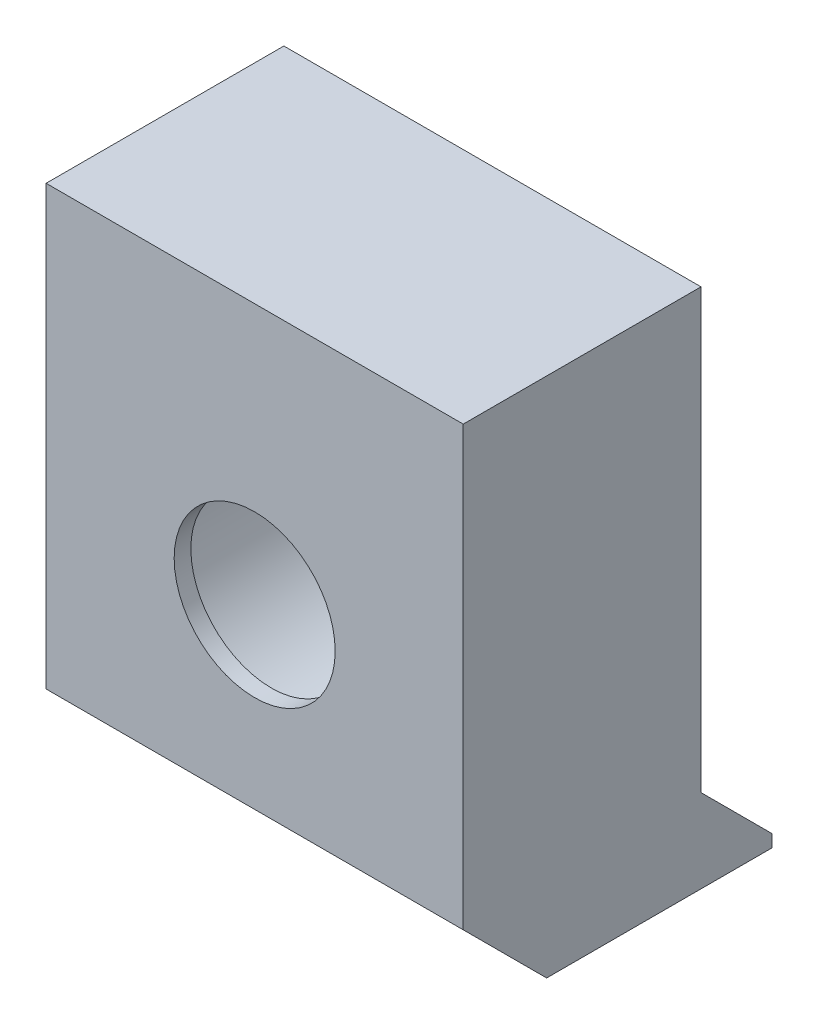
ISO-10303-21;
HEADER;
FILE_DESCRIPTION(('STEP AP214'),'2;1');
FILE_NAME('part.step','',(''),(''),'','','');
FILE_SCHEMA(('AUTOMOTIVE_DESIGN { 1 0 10303 214 1 1 1 1 }'));
ENDSEC;
DATA;
#1=APPLICATION_CONTEXT('core data for automotive mechanical design processes');
#2=APPLICATION_PROTOCOL_DEFINITION('international standard','automotive_design',2000,#1);
#3=PRODUCT_CONTEXT('',#1,'mechanical');
#4=PRODUCT('Part','Part','',(#3));
#5=PRODUCT_RELATED_PRODUCT_CATEGORY('part','',(#4));
#6=PRODUCT_DEFINITION_FORMATION('','',#4);
#7=PRODUCT_DEFINITION_CONTEXT('part definition',#1,'design');
#8=PRODUCT_DEFINITION('design','',#6,#7);
#9=PRODUCT_DEFINITION_SHAPE('','',#8);
#10=(LENGTH_UNIT() NAMED_UNIT(*) SI_UNIT(.MILLI.,.METRE.));
#11=(NAMED_UNIT(*) PLANE_ANGLE_UNIT() SI_UNIT($,.RADIAN.));
#12=(NAMED_UNIT(*) SI_UNIT($,.STERADIAN.) SOLID_ANGLE_UNIT());
#13=UNCERTAINTY_MEASURE_WITH_UNIT(LENGTH_MEASURE(1.E-05),#10,'distance_accuracy_value','');
#14=(GEOMETRIC_REPRESENTATION_CONTEXT(3) GLOBAL_UNCERTAINTY_ASSIGNED_CONTEXT((#13)) GLOBAL_UNIT_ASSIGNED_CONTEXT((#10,
#11,#12)) REPRESENTATION_CONTEXT('',''));
#15=CARTESIAN_POINT('',(0.,0.,0.));
#16=DIRECTION('',(0.,0.,1.));
#17=DIRECTION('',(1.,0.,0.));
#18=AXIS2_PLACEMENT_3D('',#15,#16,#17);
#19=CARTESIAN_POINT('',(0.,0.,36.9070876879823));
#20=DIRECTION('',(0.,0.,-1.));
#21=DIRECTION('',(-1.,0.,0.));
#22=AXIS2_PLACEMENT_3D('',#19,#20,#21);
#23=CYLINDRICAL_SURFACE('',#22,7.92988);
#24=CARTESIAN_POINT('',(0.,0.,13.462));
#25=DIRECTION('',(0.,0.,-1.));
#26=DIRECTION('',(-1.,0.,0.));
#27=AXIS2_PLACEMENT_3D('',#24,#25,#26);
#28=CIRCLE('',#27,7.92988);
#29=CARTESIAN_POINT('',(-7.92988,0.,13.462));
#30=VERTEX_POINT('',#29);
#31=EDGE_CURVE('E174',#30,#30,#28,.T.);
#32=ORIENTED_EDGE('',*,*,#31,.F.);
#33=EDGE_LOOP('',(#32));
#34=FACE_BOUND('',#33,.T.);
#35=CARTESIAN_POINT('',(0.,0.,2.54));
#36=DIRECTION('',(0.,0.,-1.));
#37=DIRECTION('',(-1.,0.,0.));
#38=AXIS2_PLACEMENT_3D('',#35,#36,#37);
#39=CIRCLE('',#38,7.92988);
#40=CARTESIAN_POINT('',(-7.92988,0.,2.54));
#41=VERTEX_POINT('',#40);
#42=EDGE_CURVE('E54',#41,#41,#39,.T.);
#43=ORIENTED_EDGE('',*,*,#42,.T.);
#44=EDGE_LOOP('',(#43));
#45=FACE_BOUND('',#44,.T.);
#46=ADVANCED_FACE('F50',(#34,#45),#23,.F.);
#47=CARTESIAN_POINT('',(-12.7,15.875,0.));
#48=DIRECTION('',(0.,0.,-1.));
#49=DIRECTION('',(-1.,0.,0.));
#50=AXIS2_PLACEMENT_3D('',#47,#48,#49);
#51=PLANE('',#50);
#52=CARTESIAN_POINT('',(0.,0.,0.));
#53=DIRECTION('',(0.,0.,-1.));
#54=DIRECTION('',(-1.,0.,0.));
#55=AXIS2_PLACEMENT_3D('',#52,#53,#54);
#56=CIRCLE('',#55,7.9502);
#57=CARTESIAN_POINT('',(-7.9502,0.,0.));
#58=VERTEX_POINT('',#57);
#59=EDGE_CURVE('E183',#58,#58,#56,.T.);
#60=ORIENTED_EDGE('',*,*,#59,.F.);
#61=EDGE_LOOP('',(#60));
#62=FACE_BOUND('',#61,.T.);
#63=DIRECTION('',(0.,1.,0.));
#64=VECTOR('',#63,1.);
#65=CARTESIAN_POINT('',(12.7,15.875,0.));
#66=LINE('',#65,#64);
#67=CARTESIAN_POINT('',(12.7,-10.795,0.));
#68=VERTEX_POINT('',#67);
#69=CARTESIAN_POINT('',(12.7,15.875,0.));
#70=VERTEX_POINT('',#69);
#71=EDGE_CURVE('E135',#68,#70,#66,.T.);
#72=ORIENTED_EDGE('',*,*,#71,.F.);
#73=DIRECTION('',(-1.,0.,0.));
#74=VECTOR('',#73,1.);
#75=CARTESIAN_POINT('',(19.8842048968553,-10.795,0.));
#76=LINE('',#75,#74);
#77=CARTESIAN_POINT('',(-12.7,-10.795,0.));
#78=VERTEX_POINT('',#77);
#79=EDGE_CURVE('E130',#68,#78,#76,.T.);
#80=ORIENTED_EDGE('',*,*,#79,.T.);
#81=DIRECTION('',(0.,-1.,0.));
#82=VECTOR('',#81,1.);
#83=CARTESIAN_POINT('',(-12.7,-15.875,0.));
#84=LINE('',#83,#82);
#85=CARTESIAN_POINT('',(-12.7,15.875,0.));
#86=VERTEX_POINT('',#85);
#87=EDGE_CURVE('E132',#86,#78,#84,.T.);
#88=ORIENTED_EDGE('',*,*,#87,.F.);
#89=DIRECTION('',(-1.,0.,0.));
#90=VECTOR('',#89,1.);
#91=CARTESIAN_POINT('',(-12.7,15.875,0.));
#92=LINE('',#91,#90);
#93=EDGE_CURVE('E157',#70,#86,#92,.T.);
#94=ORIENTED_EDGE('',*,*,#93,.F.);
#95=EDGE_LOOP('',(#72,#80,#88,#94));
#96=FACE_BOUND('',#95,.T.);
#97=ADVANCED_FACE('F204',(#62,#96),#51,.T.);
#98=CARTESIAN_POINT('',(0.,0.,-5.080025));
#99=DIRECTION('',(0.,0.,1.));
#100=DIRECTION('',(1.,0.,0.));
#101=AXIS2_PLACEMENT_3D('',#98,#99,#100);
#102=CYLINDRICAL_SURFACE('',#101,4.9022);
#103=CARTESIAN_POINT('',(0.,0.,14.478));
#104=DIRECTION('',(0.,0.,-1.));
#105=DIRECTION('',(-1.,0.,0.));
#106=AXIS2_PLACEMENT_3D('',#103,#104,#105);
#107=CIRCLE('',#106,4.9022);
#108=CARTESIAN_POINT('',(-4.9022,0.,14.478));
#109=VERTEX_POINT('',#108);
#110=EDGE_CURVE('E151',#109,#109,#107,.T.);
#111=ORIENTED_EDGE('',*,*,#110,.F.);
#112=EDGE_LOOP('',(#111));
#113=FACE_BOUND('',#112,.T.);
#114=CARTESIAN_POINT('',(0.,0.,13.462));
#115=DIRECTION('',(0.,0.,-1.));
#116=DIRECTION('',(-1.,0.,0.));
#117=AXIS2_PLACEMENT_3D('',#114,#115,#116);
#118=CIRCLE('',#117,4.9022);
#119=CARTESIAN_POINT('',(-4.9022,0.,13.462));
#120=VERTEX_POINT('',#119);
#121=EDGE_CURVE('E141',#120,#120,#118,.T.);
#122=ORIENTED_EDGE('',*,*,#121,.T.);
#123=EDGE_LOOP('',(#122));
#124=FACE_BOUND('',#123,.T.);
#125=ADVANCED_FACE('F210',(#113,#124),#102,.F.);
#126=CARTESIAN_POINT('',(-12.7,15.875,14.478));
#127=DIRECTION('',(0.,0.,-1.));
#128=DIRECTION('',(-1.,0.,0.));
#129=AXIS2_PLACEMENT_3D('',#126,#127,#128);
#130=PLANE('',#129);
#131=DIRECTION('',(0.,-1.,0.));
#132=VECTOR('',#131,1.);
#133=CARTESIAN_POINT('',(-12.7,-15.875,14.478));
#134=LINE('',#133,#132);
#135=CARTESIAN_POINT('',(-12.7,15.875,14.478));
#136=VERTEX_POINT('',#135);
#137=CARTESIAN_POINT('',(-12.7,-10.795,14.478));
#138=VERTEX_POINT('',#137);
#139=EDGE_CURVE('E153',#136,#138,#134,.T.);
#140=ORIENTED_EDGE('',*,*,#139,.T.);
#141=DIRECTION('',(1.,0.,0.));
#142=VECTOR('',#141,1.);
#143=CARTESIAN_POINT('',(-12.7,-10.795,14.478));
#144=LINE('',#143,#142);
#145=CARTESIAN_POINT('',(12.7,-10.795,14.478));
#146=VERTEX_POINT('',#145);
#147=EDGE_CURVE('E119',#138,#146,#144,.T.);
#148=ORIENTED_EDGE('',*,*,#147,.T.);
#149=DIRECTION('',(0.,1.,0.));
#150=VECTOR('',#149,1.);
#151=CARTESIAN_POINT('',(12.7,15.875,14.478));
#152=LINE('',#151,#150);
#153=CARTESIAN_POINT('',(12.7,15.875,14.478));
#154=VERTEX_POINT('',#153);
#155=EDGE_CURVE('E156',#146,#154,#152,.T.);
#156=ORIENTED_EDGE('',*,*,#155,.T.);
#157=DIRECTION('',(-1.,0.,0.));
#158=VECTOR('',#157,1.);
#159=CARTESIAN_POINT('',(-12.7,15.875,14.478));
#160=LINE('',#159,#158);
#161=EDGE_CURVE('E159',#154,#136,#160,.T.);
#162=ORIENTED_EDGE('',*,*,#161,.T.);
#163=EDGE_LOOP('',(#140,#148,#156,#162));
#164=FACE_BOUND('',#163,.T.);
#165=ORIENTED_EDGE('',*,*,#110,.T.);
#166=EDGE_LOOP('',(#165));
#167=FACE_BOUND('',#166,.T.);
#168=ADVANCED_FACE('F219',(#164,#167),#130,.F.);
#169=CARTESIAN_POINT('',(-12.7,-15.875,14.478));
#170=DIRECTION('',(1.,0.,0.));
#171=DIRECTION('',(0.,0.,-1.));
#172=AXIS2_PLACEMENT_3D('',#169,#170,#171);
#173=PLANE('',#172);
#174=DIRECTION('',(0.,0.,-1.));
#175=VECTOR('',#174,1.);
#176=CARTESIAN_POINT('',(-12.7,-15.875,14.478));
#177=LINE('',#176,#175);
#178=CARTESIAN_POINT('',(-12.7,-15.875,9.39799999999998));
#179=VERTEX_POINT('',#178);
#180=CARTESIAN_POINT('',(-12.7,-15.875,-4.318));
#181=VERTEX_POINT('',#180);
#182=EDGE_CURVE('E120',#179,#181,#177,.T.);
#183=ORIENTED_EDGE('',*,*,#182,.F.);
#184=DIRECTION('',(0.,-0.707106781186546,-0.707106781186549));
#185=VECTOR('',#184,1.);
#186=CARTESIAN_POINT('',(-12.7,-10.795,14.478));
#187=LINE('',#186,#185);
#188=EDGE_CURVE('E13',#179,#138,#187,.F.);
#189=ORIENTED_EDGE('',*,*,#188,.T.);
#190=ORIENTED_EDGE('',*,*,#139,.F.);
#191=DIRECTION('',(0.,0.,-1.));
#192=VECTOR('',#191,1.);
#193=CARTESIAN_POINT('',(-12.7,15.875,14.478));
#194=LINE('',#193,#192);
#195=EDGE_CURVE('E161',#136,#86,#194,.T.);
#196=ORIENTED_EDGE('',*,*,#195,.T.);
#197=ORIENTED_EDGE('',*,*,#87,.T.);
#198=DIRECTION('',(0.,-0.707106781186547,-0.707106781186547));
#199=VECTOR('',#198,1.);
#200=CARTESIAN_POINT('',(-12.7,-10.795,0.));
#201=LINE('',#200,#199);
#202=CARTESIAN_POINT('',(-12.7,-15.113,-4.318));
#203=VERTEX_POINT('',#202);
#204=EDGE_CURVE('E137',#78,#203,#201,.T.);
#205=ORIENTED_EDGE('',*,*,#204,.T.);
#206=DIRECTION('',(0.,-1.,0.));
#207=VECTOR('',#206,1.);
#208=CARTESIAN_POINT('',(-12.7,-15.875,-4.318));
#209=LINE('',#208,#207);
#210=EDGE_CURVE('E115',#203,#181,#209,.T.);
#211=ORIENTED_EDGE('',*,*,#210,.T.);
#212=EDGE_LOOP('',(#183,#189,#190,#196,#197,#205,#211));
#213=FACE_BOUND('',#212,.T.);
#214=ADVANCED_FACE('F225',(#213),#173,.F.);
#215=CARTESIAN_POINT('',(12.7,-15.875,14.478));
#216=DIRECTION('',(0.,1.,0.));
#217=DIRECTION('',(-1.,0.,0.));
#218=AXIS2_PLACEMENT_3D('',#215,#216,#217);
#219=PLANE('',#218);
#220=DIRECTION('',(0.,0.,-1.));
#221=VECTOR('',#220,1.);
#222=CARTESIAN_POINT('',(12.7,-15.875,14.478));
#223=LINE('',#222,#221);
#224=CARTESIAN_POINT('',(12.7,-15.875,9.39799999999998));
#225=VERTEX_POINT('',#224);
#226=CARTESIAN_POINT('',(12.7,-15.875,-4.318));
#227=VERTEX_POINT('',#226);
#228=EDGE_CURVE('E125',#225,#227,#223,.T.);
#229=ORIENTED_EDGE('',*,*,#228,.F.);
#230=DIRECTION('',(-1.,0.,0.));
#231=VECTOR('',#230,1.);
#232=CARTESIAN_POINT('',(12.7,-15.875,9.39799999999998));
#233=LINE('',#232,#231);
#234=EDGE_CURVE('E59',#225,#179,#233,.T.);
#235=ORIENTED_EDGE('',*,*,#234,.T.);
#236=ORIENTED_EDGE('',*,*,#182,.T.);
#237=DIRECTION('',(1.,0.,0.));
#238=VECTOR('',#237,1.);
#239=CARTESIAN_POINT('',(-12.70005,-15.875,-4.318));
#240=LINE('',#239,#238);
#241=EDGE_CURVE('E126',#181,#227,#240,.T.);
#242=ORIENTED_EDGE('',*,*,#241,.T.);
#243=EDGE_LOOP('',(#229,#235,#236,#242));
#244=FACE_BOUND('',#243,.T.);
#245=ADVANCED_FACE('F233',(#244),#219,.F.);
#246=CARTESIAN_POINT('',(12.7,15.875,14.478));
#247=DIRECTION('',(-1.,0.,0.));
#248=DIRECTION('',(0.,-1.,0.));
#249=AXIS2_PLACEMENT_3D('',#246,#247,#248);
#250=PLANE('',#249);
#251=ORIENTED_EDGE('',*,*,#155,.F.);
#252=DIRECTION('',(0.,0.707106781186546,0.707106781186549));
#253=VECTOR('',#252,1.);
#254=CARTESIAN_POINT('',(12.7,-10.795,14.478));
#255=LINE('',#254,#253);
#256=EDGE_CURVE('E73',#146,#225,#255,.F.);
#257=ORIENTED_EDGE('',*,*,#256,.T.);
#258=ORIENTED_EDGE('',*,*,#228,.T.);
#259=DIRECTION('',(0.,-1.,0.));
#260=VECTOR('',#259,1.);
#261=CARTESIAN_POINT('',(12.7,-15.875,-4.318));
#262=LINE('',#261,#260);
#263=CARTESIAN_POINT('',(12.7,-15.113,-4.318));
#264=VERTEX_POINT('',#263);
#265=EDGE_CURVE('E112',#264,#227,#262,.T.);
#266=ORIENTED_EDGE('',*,*,#265,.F.);
#267=DIRECTION('',(0.,0.707106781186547,0.707106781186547));
#268=VECTOR('',#267,1.);
#269=CARTESIAN_POINT('',(12.7,-10.795,0.));
#270=LINE('',#269,#268);
#271=EDGE_CURVE('E123',#264,#68,#270,.T.);
#272=ORIENTED_EDGE('',*,*,#271,.T.);
#273=ORIENTED_EDGE('',*,*,#71,.T.);
#274=DIRECTION('',(0.,0.,-1.));
#275=VECTOR('',#274,1.);
#276=CARTESIAN_POINT('',(12.7,15.875,14.478));
#277=LINE('',#276,#275);
#278=EDGE_CURVE('E247',#154,#70,#277,.T.);
#279=ORIENTED_EDGE('',*,*,#278,.F.);
#280=EDGE_LOOP('',(#251,#257,#258,#266,#272,#273,#279));
#281=FACE_BOUND('',#280,.T.);
#282=ADVANCED_FACE('F122',(#281),#250,.F.);
#283=CARTESIAN_POINT('',(-12.7,15.875,14.478));
#284=DIRECTION('',(0.,-1.,0.));
#285=DIRECTION('',(0.,0.,-1.));
#286=AXIS2_PLACEMENT_3D('',#283,#284,#285);
#287=PLANE('',#286);
#288=ORIENTED_EDGE('',*,*,#93,.T.);
#289=ORIENTED_EDGE('',*,*,#195,.F.);
#290=ORIENTED_EDGE('',*,*,#161,.F.);
#291=ORIENTED_EDGE('',*,*,#278,.T.);
#292=EDGE_LOOP('',(#288,#289,#290,#291));
#293=FACE_BOUND('',#292,.T.);
#294=ADVANCED_FACE('F223',(#293),#287,.F.);
#295=CARTESIAN_POINT('',(19.8842048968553,-10.795,0.));
#296=DIRECTION('',(0.,0.707106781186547,-0.707106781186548));
#297=DIRECTION('',(0.,0.707106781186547,0.707106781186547));
#298=AXIS2_PLACEMENT_3D('',#295,#296,#297);
#299=PLANE('',#298);
#300=DIRECTION('',(1.,0.,0.));
#301=VECTOR('',#300,1.);
#302=CARTESIAN_POINT('',(19.8842048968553,-15.113,-4.318));
#303=LINE('',#302,#301);
#304=EDGE_CURVE('E108',#203,#264,#303,.T.);
#305=ORIENTED_EDGE('',*,*,#304,.F.);
#306=ORIENTED_EDGE('',*,*,#204,.F.);
#307=ORIENTED_EDGE('',*,*,#79,.F.);
#308=ORIENTED_EDGE('',*,*,#271,.F.);
#309=EDGE_LOOP('',(#305,#306,#307,#308));
#310=FACE_BOUND('',#309,.T.);
#311=ADVANCED_FACE('F128',(#310),#299,.T.);
#312=CARTESIAN_POINT('',(-12.7,15.875,13.462));
#313=DIRECTION('',(0.,0.,-1.));
#314=DIRECTION('',(-1.,0.,0.));
#315=AXIS2_PLACEMENT_3D('',#312,#313,#314);
#316=PLANE('',#315);
#317=ORIENTED_EDGE('',*,*,#121,.F.);
#318=EDGE_LOOP('',(#317));
#319=FACE_BOUND('',#318,.T.);
#320=ORIENTED_EDGE('',*,*,#31,.T.);
#321=EDGE_LOOP('',(#320));
#322=FACE_BOUND('',#321,.T.);
#323=ADVANCED_FACE('F215',(#319,#322),#316,.T.);
#324=CARTESIAN_POINT('',(-12.70005,-15.875,-4.318));
#325=DIRECTION('',(0.,0.,1.));
#326=DIRECTION('',(1.,0.,0.));
#327=AXIS2_PLACEMENT_3D('',#324,#325,#326);
#328=PLANE('',#327);
#329=ORIENTED_EDGE('',*,*,#304,.T.);
#330=ORIENTED_EDGE('',*,*,#265,.T.);
#331=ORIENTED_EDGE('',*,*,#241,.F.);
#332=ORIENTED_EDGE('',*,*,#210,.F.);
#333=EDGE_LOOP('',(#329,#330,#331,#332));
#334=FACE_BOUND('',#333,.T.);
#335=ADVANCED_FACE('F110',(#334),#328,.F.);
#336=CARTESIAN_POINT('',(-12.7,-10.795,14.478));
#337=DIRECTION('',(0.,0.707106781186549,-0.707106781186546));
#338=DIRECTION('',(0.,0.707106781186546,0.707106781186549));
#339=AXIS2_PLACEMENT_3D('',#336,#337,#338);
#340=PLANE('',#339);
#341=ORIENTED_EDGE('',*,*,#188,.F.);
#342=ORIENTED_EDGE('',*,*,#234,.F.);
#343=ORIENTED_EDGE('',*,*,#256,.F.);
#344=ORIENTED_EDGE('',*,*,#147,.F.);
#345=EDGE_LOOP('',(#341,#342,#343,#344));
#346=FACE_BOUND('',#345,.T.);
#347=ADVANCED_FACE('F52',(#346),#340,.F.);
#348=CARTESIAN_POINT('',(0.,0.,2.54));
#349=DIRECTION('',(0.,0.,-1.));
#350=DIRECTION('',(-1.,0.,0.));
#351=AXIS2_PLACEMENT_3D('',#348,#349,#350);
#352=CYLINDRICAL_SURFACE('',#351,7.9502);
#353=CARTESIAN_POINT('',(0.,0.,2.54));
#354=DIRECTION('',(0.,0.,-1.));
#355=DIRECTION('',(-1.,0.,0.));
#356=AXIS2_PLACEMENT_3D('',#353,#354,#355);
#357=CIRCLE('',#356,7.9502);
#358=CARTESIAN_POINT('',(-7.9502,0.,2.54));
#359=VERTEX_POINT('',#358);
#360=EDGE_CURVE('E186',#359,#359,#357,.T.);
#361=ORIENTED_EDGE('',*,*,#360,.F.);
#362=EDGE_LOOP('',(#361));
#363=FACE_BOUND('',#362,.T.);
#364=ORIENTED_EDGE('',*,*,#59,.T.);
#365=EDGE_LOOP('',(#364));
#366=FACE_BOUND('',#365,.T.);
#367=ADVANCED_FACE('F196',(#363,#366),#352,.F.);
#368=CARTESIAN_POINT('',(0.,0.,2.54));
#369=DIRECTION('',(0.,0.,-1.));
#370=DIRECTION('',(-1.,0.,0.));
#371=AXIS2_PLACEMENT_3D('',#368,#369,#370);
#372=PLANE('',#371);
#373=ORIENTED_EDGE('',*,*,#42,.F.);
#374=EDGE_LOOP('',(#373));
#375=FACE_BOUND('',#374,.T.);
#376=ORIENTED_EDGE('',*,*,#360,.T.);
#377=EDGE_LOOP('',(#376));
#378=FACE_BOUND('',#377,.T.);
#379=ADVANCED_FACE('F194',(#375,#378),#372,.T.);
#380=CLOSED_SHELL('',(#46,#97,#125,#168,#214,#245,#282,#294,#311,#323,#335,#347,#367,#379));
#381=MANIFOLD_SOLID_BREP('B2',#380);
#382=ADVANCED_BREP_SHAPE_REPRESENTATION('',(#18,#381),#14);
#383=SHAPE_DEFINITION_REPRESENTATION(#9,#382);
ENDSEC;
END-ISO-10303-21;
